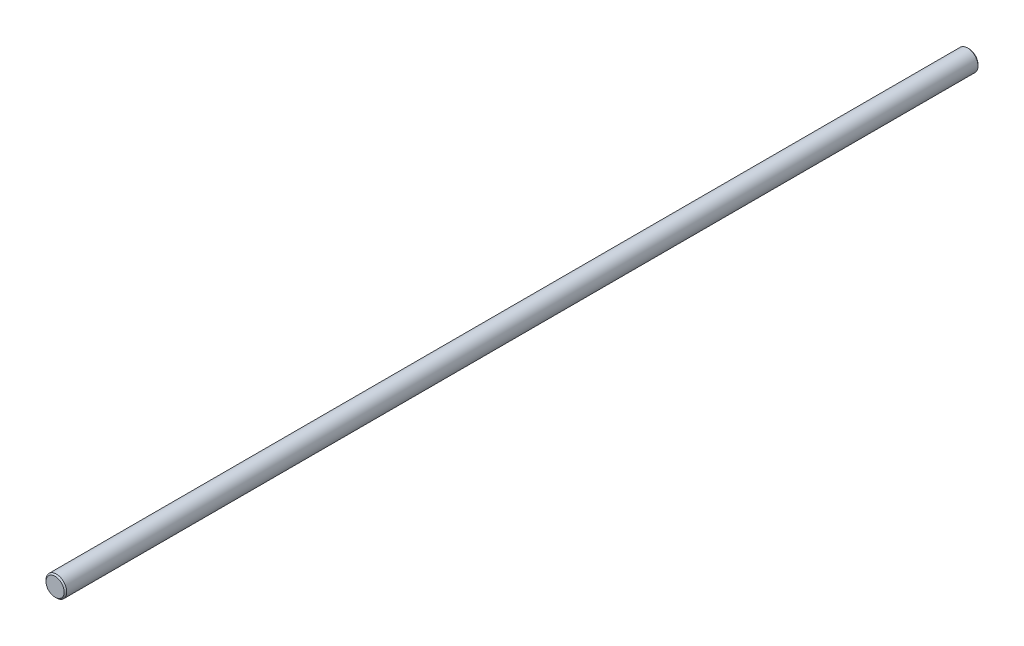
ISO-10303-21;
HEADER;
FILE_DESCRIPTION(('STEP AP214'),'2;1');
FILE_NAME('part.step','',(''),(''),'','','');
FILE_SCHEMA(('AUTOMOTIVE_DESIGN { 1 0 10303 214 1 1 1 1 }'));
ENDSEC;
DATA;
#1=APPLICATION_CONTEXT('core data for automotive mechanical design processes');
#2=APPLICATION_PROTOCOL_DEFINITION('international standard','automotive_design',2000,#1);
#3=PRODUCT_CONTEXT('',#1,'mechanical');
#4=PRODUCT('Part','Part','',(#3));
#5=PRODUCT_RELATED_PRODUCT_CATEGORY('part','',(#4));
#6=PRODUCT_DEFINITION_FORMATION('','',#4);
#7=PRODUCT_DEFINITION_CONTEXT('part definition',#1,'design');
#8=PRODUCT_DEFINITION('design','',#6,#7);
#9=PRODUCT_DEFINITION_SHAPE('','',#8);
#10=(LENGTH_UNIT() NAMED_UNIT(*) SI_UNIT(.MILLI.,.METRE.));
#11=(NAMED_UNIT(*) PLANE_ANGLE_UNIT() SI_UNIT($,.RADIAN.));
#12=(NAMED_UNIT(*) SI_UNIT($,.STERADIAN.) SOLID_ANGLE_UNIT());
#13=UNCERTAINTY_MEASURE_WITH_UNIT(LENGTH_MEASURE(1.E-05),#10,'distance_accuracy_value','');
#14=(GEOMETRIC_REPRESENTATION_CONTEXT(3) GLOBAL_UNCERTAINTY_ASSIGNED_CONTEXT((#13)) GLOBAL_UNIT_ASSIGNED_CONTEXT((#10,
#11,#12)) REPRESENTATION_CONTEXT('',''));
#15=CARTESIAN_POINT('',(0.,0.,0.));
#16=DIRECTION('',(0.,0.,1.));
#17=DIRECTION('',(1.,0.,0.));
#18=AXIS2_PLACEMENT_3D('',#15,#16,#17);
#19=CARTESIAN_POINT('',(0.,0.,-175.5));
#20=DIRECTION('',(0.,0.,1.));
#21=DIRECTION('',(1.,0.,0.));
#22=AXIS2_PLACEMENT_3D('',#19,#20,#21);
#23=CONICAL_SURFACE('',#22,4.,0.785398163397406);
#24=CARTESIAN_POINT('',(0.,0.,-176.));
#25=DIRECTION('',(0.,0.,1.));
#26=DIRECTION('',(1.,0.,0.));
#27=AXIS2_PLACEMENT_3D('',#24,#25,#26);
#28=CIRCLE('',#27,3.50000000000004);
#29=CARTESIAN_POINT('',(3.49999999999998,0.,-176.));
#30=VERTEX_POINT('',#29);
#31=EDGE_CURVE('E44',#30,#30,#28,.T.);
#32=ORIENTED_EDGE('',*,*,#31,.T.);
#33=EDGE_LOOP('',(#32));
#34=FACE_BOUND('',#33,.T.);
#35=CARTESIAN_POINT('',(0.,0.,-175.5));
#36=DIRECTION('',(0.,0.,1.));
#37=DIRECTION('',(1.,0.,0.));
#38=AXIS2_PLACEMENT_3D('',#35,#36,#37);
#39=CIRCLE('',#38,4.);
#40=CARTESIAN_POINT('',(3.99999999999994,0.,-175.5));
#41=VERTEX_POINT('',#40);
#42=EDGE_CURVE('E10',#41,#41,#39,.T.);
#43=ORIENTED_EDGE('',*,*,#42,.F.);
#44=EDGE_LOOP('',(#43));
#45=FACE_BOUND('',#44,.T.);
#46=ADVANCED_FACE('F30',(#34,#45),#23,.T.);
#47=CARTESIAN_POINT('',(0.,0.,-176.));
#48=DIRECTION('',(0.,0.,1.));
#49=DIRECTION('',(1.,0.,0.));
#50=AXIS2_PLACEMENT_3D('',#47,#48,#49);
#51=CYLINDRICAL_SURFACE('',#50,4.);
#52=ORIENTED_EDGE('',*,*,#42,.T.);
#53=EDGE_LOOP('',(#52));
#54=FACE_BOUND('',#53,.T.);
#55=CARTESIAN_POINT('',(0.,0.,175.5));
#56=DIRECTION('',(0.,0.,1.));
#57=DIRECTION('',(1.,0.,0.));
#58=AXIS2_PLACEMENT_3D('',#55,#56,#57);
#59=CIRCLE('',#58,4.);
#60=CARTESIAN_POINT('',(4.00000000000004,0.,175.5));
#61=VERTEX_POINT('',#60);
#62=EDGE_CURVE('E36',#61,#61,#59,.T.);
#63=ORIENTED_EDGE('',*,*,#62,.F.);
#64=EDGE_LOOP('',(#63));
#65=FACE_BOUND('',#64,.T.);
#66=ADVANCED_FACE('F63',(#54,#65),#51,.T.);
#67=CARTESIAN_POINT('',(0.,0.,176.));
#68=DIRECTION('',(0.,0.,-1.));
#69=DIRECTION('',(-1.,0.,0.));
#70=AXIS2_PLACEMENT_3D('',#67,#68,#69);
#71=CONICAL_SURFACE('',#70,3.50000000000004,0.785398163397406);
#72=ORIENTED_EDGE('',*,*,#62,.T.);
#73=EDGE_LOOP('',(#72));
#74=FACE_BOUND('',#73,.T.);
#75=CARTESIAN_POINT('',(0.,0.,176.));
#76=DIRECTION('',(0.,0.,1.));
#77=DIRECTION('',(1.,0.,0.));
#78=AXIS2_PLACEMENT_3D('',#75,#76,#77);
#79=CIRCLE('',#78,3.50000000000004);
#80=CARTESIAN_POINT('',(3.50000000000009,0.,176.));
#81=VERTEX_POINT('',#80);
#82=EDGE_CURVE('E40',#81,#81,#79,.T.);
#83=ORIENTED_EDGE('',*,*,#82,.F.);
#84=EDGE_LOOP('',(#83));
#85=FACE_BOUND('',#84,.T.);
#86=ADVANCED_FACE('F59',(#74,#85),#71,.T.);
#87=CARTESIAN_POINT('',(0.,0.,176.));
#88=DIRECTION('',(0.,0.,1.));
#89=DIRECTION('',(1.,0.,0.));
#90=AXIS2_PLACEMENT_3D('',#87,#88,#89);
#91=PLANE('',#90);
#92=ORIENTED_EDGE('',*,*,#82,.T.);
#93=EDGE_LOOP('',(#92));
#94=FACE_BOUND('',#93,.T.);
#95=ADVANCED_FACE('F54',(#94),#91,.T.);
#96=CARTESIAN_POINT('',(3.49999999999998,0.,-176.));
#97=DIRECTION('',(0.,0.,-1.));
#98=DIRECTION('',(-1.,0.,0.));
#99=AXIS2_PLACEMENT_3D('',#96,#97,#98);
#100=PLANE('',#99);
#101=ORIENTED_EDGE('',*,*,#31,.F.);
#102=EDGE_LOOP('',(#101));
#103=FACE_BOUND('',#102,.T.);
#104=ADVANCED_FACE('F52',(#103),#100,.T.);
#105=CLOSED_SHELL('',(#46,#66,#86,#95,#104));
#106=MANIFOLD_SOLID_BREP('B2',#105);
#107=ADVANCED_BREP_SHAPE_REPRESENTATION('',(#18,#106),#14);
#108=SHAPE_DEFINITION_REPRESENTATION(#9,#107);
ENDSEC;
END-ISO-10303-21;
